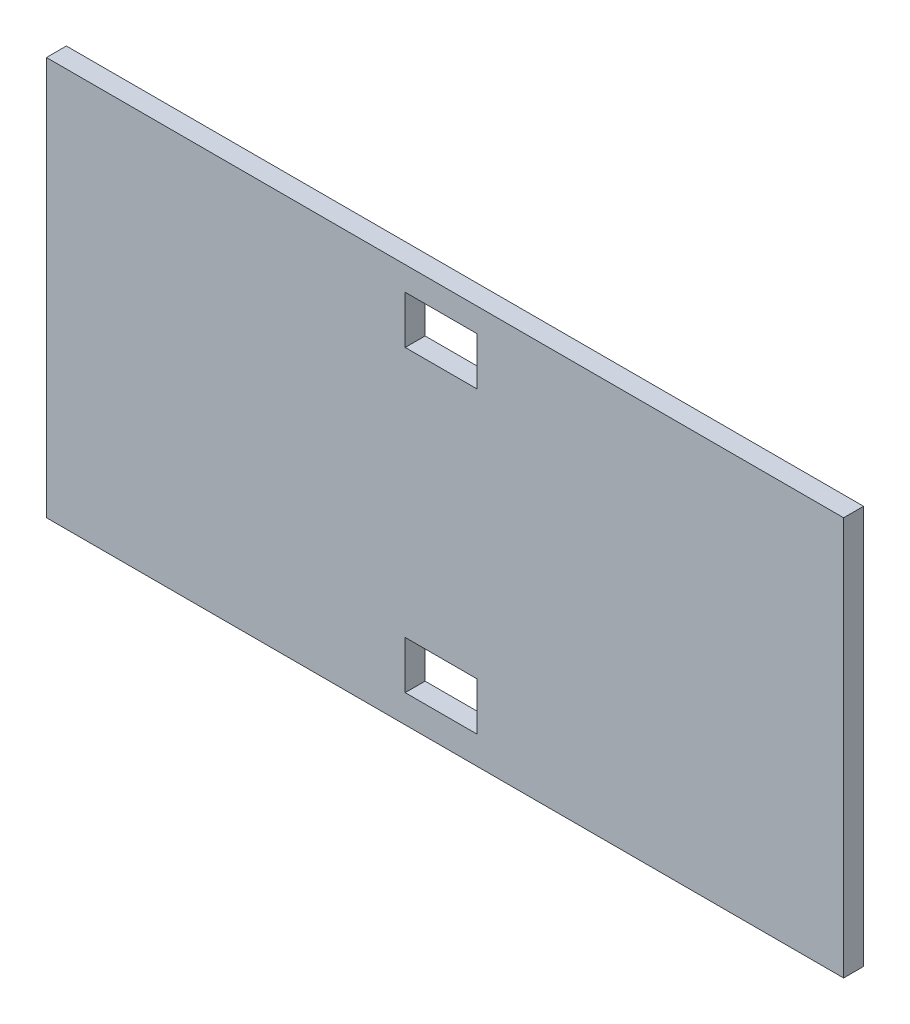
from build123d import *

# Parameters (mm, degrees)
SKETCH1_W           = 254
SKETCH1_H           = 127
BOSS_EXTRUDE1_DEPTH = 6.35
SKETCH2_W           = 22.86
SKETCH2_H           = 15.24
CUT_EXTRUDE1_DEPTH  = 6.35
LPATTERN1_COUNT     = 2
LPATTERN1_PITCH     = 95.25


with BuildPart() as part:
    # Sketch1 → Boss-Extrude1 (new body)
    with BuildSketch(Plane.XY):
        with Locations((127, 63.5)):
            Rectangle(SKETCH1_W, SKETCH1_H)
    extrude(amount=BOSS_EXTRUDE1_DEPTH)

    # Sketch2 → Cut-Extrude1 (cut)
    with BuildSketch(Plane.XY.offset(6.35)):
        with Locations((125.73, 16.51)):
            Rectangle(SKETCH2_W, SKETCH2_H)
    cut_extrude1 = extrude(amount=-CUT_EXTRUDE1_DEPTH, mode=Mode.SUBTRACT)

    # LPattern1: Cut-Extrude1 ×2
    with Locations(*[(0, i * LPATTERN1_PITCH, 0) for i in range(1, LPATTERN1_COUNT)]):
        add(cut_extrude1, mode=Mode.SUBTRACT)


solid = part.part
